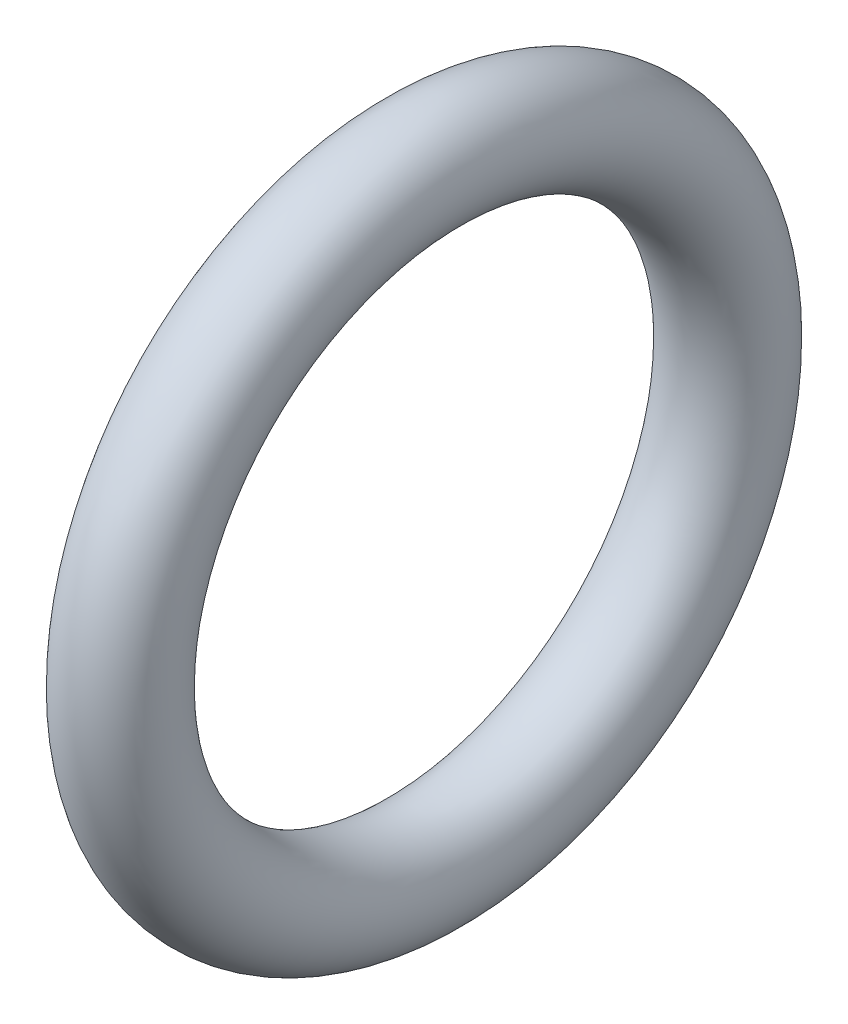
ISO-10303-21;
HEADER;
FILE_DESCRIPTION(('STEP AP214'),'2;1');
FILE_NAME('part.step','',(''),(''),'','','');
FILE_SCHEMA(('AUTOMOTIVE_DESIGN { 1 0 10303 214 1 1 1 1 }'));
ENDSEC;
DATA;
#1=APPLICATION_CONTEXT('core data for automotive mechanical design processes');
#2=APPLICATION_PROTOCOL_DEFINITION('international standard','automotive_design',2000,#1);
#3=PRODUCT_CONTEXT('',#1,'mechanical');
#4=PRODUCT('Part','Part','',(#3));
#5=PRODUCT_RELATED_PRODUCT_CATEGORY('part','',(#4));
#6=PRODUCT_DEFINITION_FORMATION('','',#4);
#7=PRODUCT_DEFINITION_CONTEXT('part definition',#1,'design');
#8=PRODUCT_DEFINITION('design','',#6,#7);
#9=PRODUCT_DEFINITION_SHAPE('','',#8);
#10=(LENGTH_UNIT() NAMED_UNIT(*) SI_UNIT(.MILLI.,.METRE.));
#11=(NAMED_UNIT(*) PLANE_ANGLE_UNIT() SI_UNIT($,.RADIAN.));
#12=(NAMED_UNIT(*) SI_UNIT($,.STERADIAN.) SOLID_ANGLE_UNIT());
#13=UNCERTAINTY_MEASURE_WITH_UNIT(LENGTH_MEASURE(1.E-05),#10,'distance_accuracy_value','');
#14=(GEOMETRIC_REPRESENTATION_CONTEXT(3) GLOBAL_UNCERTAINTY_ASSIGNED_CONTEXT((#13)) GLOBAL_UNIT_ASSIGNED_CONTEXT((#10,
#11,#12)) REPRESENTATION_CONTEXT('',''));
#15=CARTESIAN_POINT('',(0.,0.,0.));
#16=DIRECTION('',(0.,0.,1.));
#17=DIRECTION('',(1.,0.,0.));
#18=AXIS2_PLACEMENT_3D('',#15,#16,#17);
#19=CARTESIAN_POINT('',(0.,0.,0.));
#20=DIRECTION('',(-1.,0.,0.));
#21=DIRECTION('',(0.,0.,1.));
#22=AXIS2_PLACEMENT_3D('',#19,#20,#21);
#23=TOROIDAL_SURFACE('',#22,7.25,1.25);
#24=CARTESIAN_POINT('',(0.,0.,8.5));
#25=VERTEX_POINT('',#24);
#26=VERTEX_LOOP('',#25);
#27=FACE_BOUND('',#26,.T.);
#28=ADVANCED_FACE('F34',(#27),#23,.T.);
#29=CLOSED_SHELL('',(#28));
#30=MANIFOLD_SOLID_BREP('B2',#29);
#31=ADVANCED_BREP_SHAPE_REPRESENTATION('',(#18,#30),#14);
#32=SHAPE_DEFINITION_REPRESENTATION(#9,#31);
ENDSEC;
END-ISO-10303-21;
